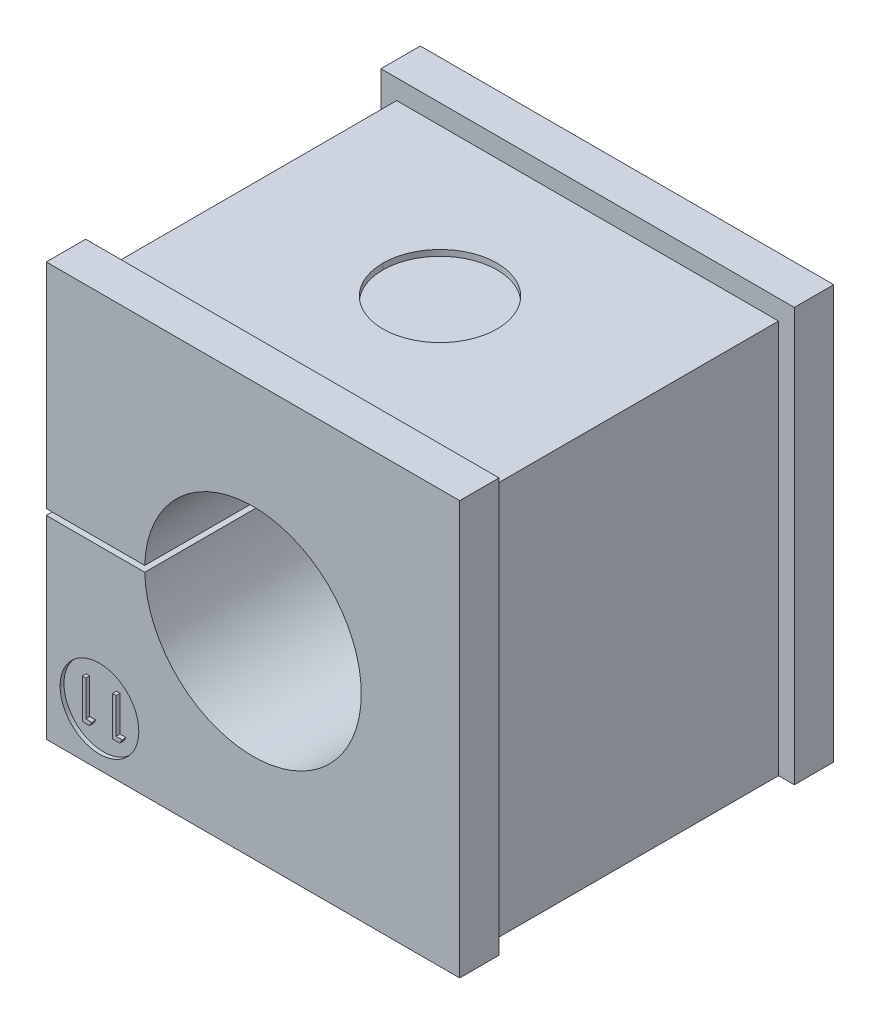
ISO-10303-21;
HEADER;
FILE_DESCRIPTION(('STEP AP214'),'2;1');
FILE_NAME('part.step','',(''),(''),'','','');
FILE_SCHEMA(('AUTOMOTIVE_DESIGN { 1 0 10303 214 1 1 1 1 }'));
ENDSEC;
DATA;
#1=APPLICATION_CONTEXT('core data for automotive mechanical design processes');
#2=APPLICATION_PROTOCOL_DEFINITION('international standard','automotive_design',2000,#1);
#3=PRODUCT_CONTEXT('',#1,'mechanical');
#4=PRODUCT('Part','Part','',(#3));
#5=PRODUCT_RELATED_PRODUCT_CATEGORY('part','',(#4));
#6=PRODUCT_DEFINITION_FORMATION('','',#4);
#7=PRODUCT_DEFINITION_CONTEXT('part definition',#1,'design');
#8=PRODUCT_DEFINITION('design','',#6,#7);
#9=PRODUCT_DEFINITION_SHAPE('','',#8);
#10=(LENGTH_UNIT() NAMED_UNIT(*) SI_UNIT(.MILLI.,.METRE.));
#11=(NAMED_UNIT(*) PLANE_ANGLE_UNIT() SI_UNIT($,.RADIAN.));
#12=(NAMED_UNIT(*) SI_UNIT($,.STERADIAN.) SOLID_ANGLE_UNIT());
#13=UNCERTAINTY_MEASURE_WITH_UNIT(LENGTH_MEASURE(1.E-05),#10,'distance_accuracy_value','');
#14=(GEOMETRIC_REPRESENTATION_CONTEXT(3) GLOBAL_UNCERTAINTY_ASSIGNED_CONTEXT((#13)) GLOBAL_UNIT_ASSIGNED_CONTEXT((#10,
#11,#12)) REPRESENTATION_CONTEXT('',''));
#15=CARTESIAN_POINT('',(0.,0.,0.));
#16=DIRECTION('',(0.,0.,1.));
#17=DIRECTION('',(1.,0.,0.));
#18=AXIS2_PLACEMENT_3D('',#15,#16,#17);
#19=CARTESIAN_POINT('',(0.,0.,9.5));
#20=DIRECTION('',(0.,0.,-1.));
#21=DIRECTION('',(0.,-1.,0.));
#22=AXIS2_PLACEMENT_3D('',#19,#20,#21);
#23=PLANE('',#22);
#24=DIRECTION('',(-0.496686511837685,-0.867930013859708,0.));
#25=VECTOR('',#24,1.);
#26=CARTESIAN_POINT('',(2.31538461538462,-8.59487179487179,9.5));
#27=LINE('',#26,#25);
#28=CARTESIAN_POINT('',(2.31538461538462,-8.59487179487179,9.5));
#29=VERTEX_POINT('',#28);
#30=CARTESIAN_POINT('',(2.19799679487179,-8.8,9.5));
#31=VERTEX_POINT('',#30);
#32=EDGE_CURVE('E398',#29,#31,#27,.T.);
#33=ORIENTED_EDGE('',*,*,#32,.F.);
#34=DIRECTION('',(1.,0.,0.));
#35=VECTOR('',#34,1.);
#36=CARTESIAN_POINT('',(2.00769230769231,-8.59487179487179,9.5));
#37=LINE('',#36,#35);
#38=CARTESIAN_POINT('',(2.00769230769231,-8.59487179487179,9.5));
#39=VERTEX_POINT('',#38);
#40=EDGE_CURVE('E308',#39,#29,#37,.T.);
#41=ORIENTED_EDGE('',*,*,#40,.F.);
#42=DIRECTION('',(0.,-1.,0.));
#43=VECTOR('',#42,1.);
#44=CARTESIAN_POINT('',(2.00769230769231,-6.8,9.5));
#45=LINE('',#44,#43);
#46=CARTESIAN_POINT('',(2.00769230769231,-6.8,9.5));
#47=VERTEX_POINT('',#46);
#48=EDGE_CURVE('E306',#47,#39,#45,.T.);
#49=ORIENTED_EDGE('',*,*,#48,.F.);
#50=DIRECTION('',(1.,0.,0.));
#51=VECTOR('',#50,1.);
#52=CARTESIAN_POINT('',(1.82820512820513,-6.8,9.5));
#53=LINE('',#52,#51);
#54=CARTESIAN_POINT('',(1.82820512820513,-6.8,9.5));
#55=VERTEX_POINT('',#54);
#56=EDGE_CURVE('E18',#55,#47,#53,.T.);
#57=ORIENTED_EDGE('',*,*,#56,.F.);
#58=DIRECTION('',(0.,1.,0.));
#59=VECTOR('',#58,1.);
#60=CARTESIAN_POINT('',(1.82820512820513,-8.8,9.5));
#61=LINE('',#60,#59);
#62=CARTESIAN_POINT('',(1.82820512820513,-8.8,9.5));
#63=VERTEX_POINT('',#62);
#64=EDGE_CURVE('E25',#63,#55,#61,.T.);
#65=ORIENTED_EDGE('',*,*,#64,.F.);
#66=DIRECTION('',(-1.,0.,0.));
#67=VECTOR('',#66,1.);
#68=CARTESIAN_POINT('',(2.19799679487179,-8.8,9.5));
#69=LINE('',#68,#67);
#70=EDGE_CURVE('E9',#31,#63,#69,.T.);
#71=ORIENTED_EDGE('',*,*,#70,.F.);
#72=EDGE_LOOP('',(#33,#41,#49,#57,#65,#71));
#73=FACE_BOUND('',#72,.T.);
#74=ADVANCED_FACE('F15',(#73),#23,.F.);
#75=CARTESIAN_POINT('',(2.19799679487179,-8.8,9.5));
#76=DIRECTION('',(0.,-1.,0.));
#77=DIRECTION('',(0.,0.,-1.));
#78=AXIS2_PLACEMENT_3D('',#75,#76,#77);
#79=PLANE('',#78);
#80=DIRECTION('',(-1.,0.,0.));
#81=VECTOR('',#80,1.);
#82=CARTESIAN_POINT('',(2.19799679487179,-8.8,9.3));
#83=LINE('',#82,#81);
#84=CARTESIAN_POINT('',(2.19799679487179,-8.8,9.3));
#85=VERTEX_POINT('',#84);
#86=CARTESIAN_POINT('',(1.82820512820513,-8.8,9.3));
#87=VERTEX_POINT('',#86);
#88=EDGE_CURVE('E341',#85,#87,#83,.T.);
#89=ORIENTED_EDGE('',*,*,#88,.F.);
#90=DIRECTION('',(0.,0.,-1.));
#91=VECTOR('',#90,1.);
#92=CARTESIAN_POINT('',(2.19799679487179,-8.8,9.5));
#93=LINE('',#92,#91);
#94=EDGE_CURVE('E406',#31,#85,#93,.T.);
#95=ORIENTED_EDGE('',*,*,#94,.F.);
#96=ORIENTED_EDGE('',*,*,#70,.T.);
#97=DIRECTION('',(0.,0.,-1.));
#98=VECTOR('',#97,1.);
#99=CARTESIAN_POINT('',(1.82820512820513,-8.8,9.5));
#100=LINE('',#99,#98);
#101=EDGE_CURVE('E304',#63,#87,#100,.T.);
#102=ORIENTED_EDGE('',*,*,#101,.T.);
#103=EDGE_LOOP('',(#89,#95,#96,#102));
#104=FACE_BOUND('',#103,.T.);
#105=ADVANCED_FACE('F861',(#104),#79,.T.);
#106=CARTESIAN_POINT('',(1.82820512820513,-8.8,9.5));
#107=DIRECTION('',(-1.,0.,0.));
#108=DIRECTION('',(0.,0.,1.));
#109=AXIS2_PLACEMENT_3D('',#106,#107,#108);
#110=PLANE('',#109);
#111=DIRECTION('',(0.,1.,0.));
#112=VECTOR('',#111,1.);
#113=CARTESIAN_POINT('',(1.82820512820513,-8.8,9.3));
#114=LINE('',#113,#112);
#115=CARTESIAN_POINT('',(1.82820512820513,-6.8,9.3));
#116=VERTEX_POINT('',#115);
#117=EDGE_CURVE('E331',#87,#116,#114,.T.);
#118=ORIENTED_EDGE('',*,*,#117,.F.);
#119=ORIENTED_EDGE('',*,*,#101,.F.);
#120=ORIENTED_EDGE('',*,*,#64,.T.);
#121=DIRECTION('',(0.,0.,-1.));
#122=VECTOR('',#121,1.);
#123=CARTESIAN_POINT('',(1.82820512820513,-6.8,9.5));
#124=LINE('',#123,#122);
#125=EDGE_CURVE('E301',#55,#116,#124,.T.);
#126=ORIENTED_EDGE('',*,*,#125,.T.);
#127=EDGE_LOOP('',(#118,#119,#120,#126));
#128=FACE_BOUND('',#127,.T.);
#129=ADVANCED_FACE('F328',(#128),#110,.T.);
#130=CARTESIAN_POINT('',(1.82820512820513,-6.8,9.5));
#131=DIRECTION('',(0.,1.,0.));
#132=DIRECTION('',(1.,0.,0.));
#133=AXIS2_PLACEMENT_3D('',#130,#131,#132);
#134=PLANE('',#133);
#135=DIRECTION('',(1.,0.,0.));
#136=VECTOR('',#135,1.);
#137=CARTESIAN_POINT('',(1.82820512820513,-6.8,9.3));
#138=LINE('',#137,#136);
#139=CARTESIAN_POINT('',(2.00769230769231,-6.8,9.3));
#140=VERTEX_POINT('',#139);
#141=EDGE_CURVE('E333',#116,#140,#138,.T.);
#142=ORIENTED_EDGE('',*,*,#141,.F.);
#143=ORIENTED_EDGE('',*,*,#125,.F.);
#144=ORIENTED_EDGE('',*,*,#56,.T.);
#145=DIRECTION('',(0.,0.,-1.));
#146=VECTOR('',#145,1.);
#147=CARTESIAN_POINT('',(2.00769230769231,-6.8,9.5));
#148=LINE('',#147,#146);
#149=EDGE_CURVE('E299',#47,#140,#148,.T.);
#150=ORIENTED_EDGE('',*,*,#149,.T.);
#151=EDGE_LOOP('',(#142,#143,#144,#150));
#152=FACE_BOUND('',#151,.T.);
#153=ADVANCED_FACE('F297',(#152),#134,.T.);
#154=CARTESIAN_POINT('',(2.00769230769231,-6.8,9.5));
#155=DIRECTION('',(1.,0.,0.));
#156=DIRECTION('',(0.,1.,0.));
#157=AXIS2_PLACEMENT_3D('',#154,#155,#156);
#158=PLANE('',#157);
#159=DIRECTION('',(0.,-1.,0.));
#160=VECTOR('',#159,1.);
#161=CARTESIAN_POINT('',(2.00769230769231,-6.8,9.3));
#162=LINE('',#161,#160);
#163=CARTESIAN_POINT('',(2.00769230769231,-8.59487179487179,9.3));
#164=VERTEX_POINT('',#163);
#165=EDGE_CURVE('E315',#140,#164,#162,.T.);
#166=ORIENTED_EDGE('',*,*,#165,.F.);
#167=ORIENTED_EDGE('',*,*,#149,.F.);
#168=ORIENTED_EDGE('',*,*,#48,.T.);
#169=DIRECTION('',(0.,0.,-1.));
#170=VECTOR('',#169,1.);
#171=CARTESIAN_POINT('',(2.00769230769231,-8.59487179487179,9.5));
#172=LINE('',#171,#170);
#173=EDGE_CURVE('E321',#39,#164,#172,.T.);
#174=ORIENTED_EDGE('',*,*,#173,.T.);
#175=EDGE_LOOP('',(#166,#167,#168,#174));
#176=FACE_BOUND('',#175,.T.);
#177=ADVANCED_FACE('F313',(#176),#158,.T.);
#178=CARTESIAN_POINT('',(2.00769230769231,-8.59487179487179,9.5));
#179=DIRECTION('',(0.,1.,0.));
#180=DIRECTION('',(1.,0.,0.));
#181=AXIS2_PLACEMENT_3D('',#178,#179,#180);
#182=PLANE('',#181);
#183=DIRECTION('',(1.,0.,0.));
#184=VECTOR('',#183,1.);
#185=CARTESIAN_POINT('',(2.00769230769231,-8.59487179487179,9.3));
#186=LINE('',#185,#184);
#187=CARTESIAN_POINT('',(2.31538461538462,-8.59487179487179,9.3));
#188=VERTEX_POINT('',#187);
#189=EDGE_CURVE('E355',#164,#188,#186,.T.);
#190=ORIENTED_EDGE('',*,*,#189,.F.);
#191=ORIENTED_EDGE('',*,*,#173,.F.);
#192=ORIENTED_EDGE('',*,*,#40,.T.);
#193=DIRECTION('',(0.,0.,-1.));
#194=VECTOR('',#193,1.);
#195=CARTESIAN_POINT('',(2.31538461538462,-8.59487179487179,9.5));
#196=LINE('',#195,#194);
#197=EDGE_CURVE('E396',#29,#188,#196,.T.);
#198=ORIENTED_EDGE('',*,*,#197,.T.);
#199=EDGE_LOOP('',(#190,#191,#192,#198));
#200=FACE_BOUND('',#199,.T.);
#201=ADVANCED_FACE('F523',(#200),#182,.T.);
#202=CARTESIAN_POINT('',(2.31538461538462,-8.59487179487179,9.5));
#203=DIRECTION('',(0.867930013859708,-0.496686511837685,0.));
#204=DIRECTION('',(0.,0.,-1.));
#205=AXIS2_PLACEMENT_3D('',#202,#203,#204);
#206=PLANE('',#205);
#207=DIRECTION('',(-0.496686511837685,-0.867930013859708,0.));
#208=VECTOR('',#207,1.);
#209=CARTESIAN_POINT('',(2.31538461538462,-8.59487179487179,9.3));
#210=LINE('',#209,#208);
#211=EDGE_CURVE('E347',#188,#85,#210,.T.);
#212=ORIENTED_EDGE('',*,*,#211,.F.);
#213=ORIENTED_EDGE('',*,*,#197,.F.);
#214=ORIENTED_EDGE('',*,*,#32,.T.);
#215=ORIENTED_EDGE('',*,*,#94,.T.);
#216=EDGE_LOOP('',(#212,#213,#214,#215));
#217=FACE_BOUND('',#216,.T.);
#218=ADVANCED_FACE('F526',(#217),#206,.T.);
#219=CARTESIAN_POINT('',(0.,0.,9.5));
#220=DIRECTION('',(0.,0.,-1.));
#221=DIRECTION('',(0.,-1.,0.));
#222=AXIS2_PLACEMENT_3D('',#219,#220,#221);
#223=PLANE('',#222);
#224=DIRECTION('',(-0.496686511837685,-0.867930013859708,0.));
#225=VECTOR('',#224,1.);
#226=CARTESIAN_POINT('',(3.85384615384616,-8.59487179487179,9.5));
#227=LINE('',#226,#225);
#228=CARTESIAN_POINT('',(3.85384615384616,-8.59487179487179,9.5));
#229=VERTEX_POINT('',#228);
#230=CARTESIAN_POINT('',(3.73645833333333,-8.8,9.5));
#231=VERTEX_POINT('',#230);
#232=EDGE_CURVE('E375',#229,#231,#227,.T.);
#233=ORIENTED_EDGE('',*,*,#232,.F.);
#234=DIRECTION('',(1.,0.,0.));
#235=VECTOR('',#234,1.);
#236=CARTESIAN_POINT('',(3.54615384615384,-8.59487179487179,9.5));
#237=LINE('',#236,#235);
#238=CARTESIAN_POINT('',(3.54615384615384,-8.59487179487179,9.5));
#239=VERTEX_POINT('',#238);
#240=EDGE_CURVE('E381',#239,#229,#237,.T.);
#241=ORIENTED_EDGE('',*,*,#240,.F.);
#242=DIRECTION('',(0.,-1.,0.));
#243=VECTOR('',#242,1.);
#244=CARTESIAN_POINT('',(3.54615384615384,-6.8,9.5));
#245=LINE('',#244,#243);
#246=CARTESIAN_POINT('',(3.54615384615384,-6.8,9.5));
#247=VERTEX_POINT('',#246);
#248=EDGE_CURVE('E388',#247,#239,#245,.T.);
#249=ORIENTED_EDGE('',*,*,#248,.F.);
#250=DIRECTION('',(1.,0.,0.));
#251=VECTOR('',#250,1.);
#252=CARTESIAN_POINT('',(3.36666666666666,-6.8,9.5));
#253=LINE('',#252,#251);
#254=CARTESIAN_POINT('',(3.36666666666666,-6.8,9.5));
#255=VERTEX_POINT('',#254);
#256=EDGE_CURVE('E389',#255,#247,#253,.T.);
#257=ORIENTED_EDGE('',*,*,#256,.F.);
#258=DIRECTION('',(0.,1.,0.));
#259=VECTOR('',#258,1.);
#260=CARTESIAN_POINT('',(3.36666666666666,-8.8,9.5));
#261=LINE('',#260,#259);
#262=CARTESIAN_POINT('',(3.36666666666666,-8.8,9.5));
#263=VERTEX_POINT('',#262);
#264=EDGE_CURVE('E395',#263,#255,#261,.T.);
#265=ORIENTED_EDGE('',*,*,#264,.F.);
#266=DIRECTION('',(-1.,0.,0.));
#267=VECTOR('',#266,1.);
#268=CARTESIAN_POINT('',(3.73645833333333,-8.8,9.5));
#269=LINE('',#268,#267);
#270=EDGE_CURVE('E399',#231,#263,#269,.T.);
#271=ORIENTED_EDGE('',*,*,#270,.F.);
#272=EDGE_LOOP('',(#233,#241,#249,#257,#265,#271));
#273=FACE_BOUND('',#272,.T.);
#274=ADVANCED_FACE('F876',(#273),#223,.F.);
#275=CARTESIAN_POINT('',(3.73645833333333,-8.8,9.5));
#276=DIRECTION('',(0.,-1.,0.));
#277=DIRECTION('',(0.,0.,-1.));
#278=AXIS2_PLACEMENT_3D('',#275,#276,#277);
#279=PLANE('',#278);
#280=DIRECTION('',(-1.,0.,0.));
#281=VECTOR('',#280,1.);
#282=CARTESIAN_POINT('',(3.73645833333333,-8.8,9.3));
#283=LINE('',#282,#281);
#284=CARTESIAN_POINT('',(3.73645833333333,-8.8,9.3));
#285=VERTEX_POINT('',#284);
#286=CARTESIAN_POINT('',(3.36666666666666,-8.8,9.3));
#287=VERTEX_POINT('',#286);
#288=EDGE_CURVE('E366',#285,#287,#283,.T.);
#289=ORIENTED_EDGE('',*,*,#288,.F.);
#290=DIRECTION('',(0.,0.,-1.));
#291=VECTOR('',#290,1.);
#292=CARTESIAN_POINT('',(3.73645833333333,-8.8,9.5));
#293=LINE('',#292,#291);
#294=EDGE_CURVE('E380',#231,#285,#293,.T.);
#295=ORIENTED_EDGE('',*,*,#294,.F.);
#296=ORIENTED_EDGE('',*,*,#270,.T.);
#297=DIRECTION('',(0.,0.,-1.));
#298=VECTOR('',#297,1.);
#299=CARTESIAN_POINT('',(3.36666666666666,-8.8,9.5));
#300=LINE('',#299,#298);
#301=EDGE_CURVE('E392',#263,#287,#300,.T.);
#302=ORIENTED_EDGE('',*,*,#301,.T.);
#303=EDGE_LOOP('',(#289,#295,#296,#302));
#304=FACE_BOUND('',#303,.T.);
#305=ADVANCED_FACE('F877',(#304),#279,.T.);
#306=CARTESIAN_POINT('',(3.36666666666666,-8.8,9.5));
#307=DIRECTION('',(-1.,0.,0.));
#308=DIRECTION('',(0.,0.,1.));
#309=AXIS2_PLACEMENT_3D('',#306,#307,#308);
#310=PLANE('',#309);
#311=DIRECTION('',(0.,1.,0.));
#312=VECTOR('',#311,1.);
#313=CARTESIAN_POINT('',(3.36666666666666,-8.8,9.3));
#314=LINE('',#313,#312);
#315=CARTESIAN_POINT('',(3.36666666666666,-6.8,9.3));
#316=VERTEX_POINT('',#315);
#317=EDGE_CURVE('E371',#287,#316,#314,.T.);
#318=ORIENTED_EDGE('',*,*,#317,.F.);
#319=ORIENTED_EDGE('',*,*,#301,.F.);
#320=ORIENTED_EDGE('',*,*,#264,.T.);
#321=DIRECTION('',(0.,0.,-1.));
#322=VECTOR('',#321,1.);
#323=CARTESIAN_POINT('',(3.36666666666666,-6.8,9.5));
#324=LINE('',#323,#322);
#325=EDGE_CURVE('E393',#255,#316,#324,.T.);
#326=ORIENTED_EDGE('',*,*,#325,.T.);
#327=EDGE_LOOP('',(#318,#319,#320,#326));
#328=FACE_BOUND('',#327,.T.);
#329=ADVANCED_FACE('F880',(#328),#310,.T.);
#330=CARTESIAN_POINT('',(3.36666666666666,-6.8,9.5));
#331=DIRECTION('',(0.,1.,0.));
#332=DIRECTION('',(1.,0.,0.));
#333=AXIS2_PLACEMENT_3D('',#330,#331,#332);
#334=PLANE('',#333);
#335=DIRECTION('',(1.,0.,0.));
#336=VECTOR('',#335,1.);
#337=CARTESIAN_POINT('',(3.36666666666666,-6.8,9.3));
#338=LINE('',#337,#336);
#339=CARTESIAN_POINT('',(3.54615384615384,-6.8,9.3));
#340=VERTEX_POINT('',#339);
#341=EDGE_CURVE('E585',#316,#340,#338,.T.);
#342=ORIENTED_EDGE('',*,*,#341,.F.);
#343=ORIENTED_EDGE('',*,*,#325,.F.);
#344=ORIENTED_EDGE('',*,*,#256,.T.);
#345=DIRECTION('',(0.,0.,-1.));
#346=VECTOR('',#345,1.);
#347=CARTESIAN_POINT('',(3.54615384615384,-6.8,9.5));
#348=LINE('',#347,#346);
#349=EDGE_CURVE('E384',#247,#340,#348,.T.);
#350=ORIENTED_EDGE('',*,*,#349,.T.);
#351=EDGE_LOOP('',(#342,#343,#344,#350));
#352=FACE_BOUND('',#351,.T.);
#353=ADVANCED_FACE('F883',(#352),#334,.T.);
#354=CARTESIAN_POINT('',(3.54615384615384,-6.8,9.5));
#355=DIRECTION('',(1.,0.,0.));
#356=DIRECTION('',(0.,1.,0.));
#357=AXIS2_PLACEMENT_3D('',#354,#355,#356);
#358=PLANE('',#357);
#359=DIRECTION('',(0.,-1.,0.));
#360=VECTOR('',#359,1.);
#361=CARTESIAN_POINT('',(3.54615384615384,-6.8,9.3));
#362=LINE('',#361,#360);
#363=CARTESIAN_POINT('',(3.54615384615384,-8.59487179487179,9.3));
#364=VERTEX_POINT('',#363);
#365=EDGE_CURVE('E440',#340,#364,#362,.T.);
#366=ORIENTED_EDGE('',*,*,#365,.F.);
#367=ORIENTED_EDGE('',*,*,#349,.F.);
#368=ORIENTED_EDGE('',*,*,#248,.T.);
#369=DIRECTION('',(0.,0.,-1.));
#370=VECTOR('',#369,1.);
#371=CARTESIAN_POINT('',(3.54615384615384,-8.59487179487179,9.5));
#372=LINE('',#371,#370);
#373=EDGE_CURVE('E385',#239,#364,#372,.T.);
#374=ORIENTED_EDGE('',*,*,#373,.T.);
#375=EDGE_LOOP('',(#366,#367,#368,#374));
#376=FACE_BOUND('',#375,.T.);
#377=ADVANCED_FACE('F887',(#376),#358,.T.);
#378=CARTESIAN_POINT('',(3.54615384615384,-8.59487179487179,9.5));
#379=DIRECTION('',(0.,1.,0.));
#380=DIRECTION('',(1.,0.,0.));
#381=AXIS2_PLACEMENT_3D('',#378,#379,#380);
#382=PLANE('',#381);
#383=DIRECTION('',(1.,0.,0.));
#384=VECTOR('',#383,1.);
#385=CARTESIAN_POINT('',(3.54615384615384,-8.59487179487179,9.3));
#386=LINE('',#385,#384);
#387=CARTESIAN_POINT('',(3.85384615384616,-8.59487179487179,9.3));
#388=VERTEX_POINT('',#387);
#389=EDGE_CURVE('E376',#364,#388,#386,.T.);
#390=ORIENTED_EDGE('',*,*,#389,.F.);
#391=ORIENTED_EDGE('',*,*,#373,.F.);
#392=ORIENTED_EDGE('',*,*,#240,.T.);
#393=DIRECTION('',(0.,0.,-1.));
#394=VECTOR('',#393,1.);
#395=CARTESIAN_POINT('',(3.85384615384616,-8.59487179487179,9.5));
#396=LINE('',#395,#394);
#397=EDGE_CURVE('E372',#229,#388,#396,.T.);
#398=ORIENTED_EDGE('',*,*,#397,.T.);
#399=EDGE_LOOP('',(#390,#391,#392,#398));
#400=FACE_BOUND('',#399,.T.);
#401=ADVANCED_FACE('F891',(#400),#382,.T.);
#402=CARTESIAN_POINT('',(3.85384615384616,-8.59487179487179,9.5));
#403=DIRECTION('',(0.867930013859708,-0.496686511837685,0.));
#404=DIRECTION('',(0.,0.,-1.));
#405=AXIS2_PLACEMENT_3D('',#402,#403,#404);
#406=PLANE('',#405);
#407=DIRECTION('',(-0.496686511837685,-0.867930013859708,0.));
#408=VECTOR('',#407,1.);
#409=CARTESIAN_POINT('',(3.85384615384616,-8.59487179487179,9.3));
#410=LINE('',#409,#408);
#411=EDGE_CURVE('E361',#388,#285,#410,.T.);
#412=ORIENTED_EDGE('',*,*,#411,.F.);
#413=ORIENTED_EDGE('',*,*,#397,.F.);
#414=ORIENTED_EDGE('',*,*,#232,.T.);
#415=ORIENTED_EDGE('',*,*,#294,.T.);
#416=EDGE_LOOP('',(#412,#413,#414,#415));
#417=FACE_BOUND('',#416,.T.);
#418=ADVANCED_FACE('F893',(#417),#406,.T.);
#419=CARTESIAN_POINT('',(10.5,-0.5,-25.0563491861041));
#420=DIRECTION('',(0.,0.,1.));
#421=DIRECTION('',(1.,0.,0.));
#422=AXIS2_PLACEMENT_3D('',#419,#420,#421);
#423=CYLINDRICAL_SURFACE('',#422,5.5);
#424=DIRECTION('',(0.,0.,1.));
#425=VECTOR('',#424,1.);
#426=CARTESIAN_POINT('',(16.,-0.5,-25.0563491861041));
#427=LINE('',#426,#425);
#428=CARTESIAN_POINT('',(16.,-0.5,-9.5));
#429=VERTEX_POINT('',#428);
#430=CARTESIAN_POINT('',(16.,-0.5,9.5));
#431=VERTEX_POINT('',#430);
#432=EDGE_CURVE('E728',#429,#431,#427,.T.);
#433=ORIENTED_EDGE('',*,*,#432,.F.);
#434=CARTESIAN_POINT('',(10.5,-0.5,-9.5));
#435=DIRECTION('',(0.,0.,1.));
#436=DIRECTION('',(-1.,0.,0.));
#437=AXIS2_PLACEMENT_3D('',#434,#435,#436);
#438=CIRCLE('',#437,5.5);
#439=CARTESIAN_POINT('',(5.0020458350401,-0.65,-9.5));
#440=VERTEX_POINT('',#439);
#441=EDGE_CURVE('E427',#440,#429,#438,.T.);
#442=ORIENTED_EDGE('',*,*,#441,.F.);
#443=DIRECTION('',(0.,0.,1.));
#444=VECTOR('',#443,1.);
#445=CARTESIAN_POINT('',(5.0020458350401,-0.65,-25.0563491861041));
#446=LINE('',#445,#444);
#447=CARTESIAN_POINT('',(5.0020458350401,-0.65,9.5));
#448=VERTEX_POINT('',#447);
#449=EDGE_CURVE('E665',#440,#448,#446,.T.);
#450=ORIENTED_EDGE('',*,*,#449,.T.);
#451=CARTESIAN_POINT('',(10.5,-0.5,9.5));
#452=DIRECTION('',(0.,0.,1.));
#453=DIRECTION('',(1.,0.,0.));
#454=AXIS2_PLACEMENT_3D('',#451,#452,#453);
#455=CIRCLE('',#454,5.5);
#456=EDGE_CURVE('E513',#448,#431,#455,.T.);
#457=ORIENTED_EDGE('',*,*,#456,.T.);
#458=EDGE_LOOP('',(#433,#442,#450,#457));
#459=FACE_BOUND('',#458,.T.);
#460=ADVANCED_FACE('F811',(#459),#423,.F.);
#461=CARTESIAN_POINT('',(2.7,-7.8,9.3));
#462=DIRECTION('',(0.,0.,1.));
#463=DIRECTION('',(1.,0.,0.));
#464=AXIS2_PLACEMENT_3D('',#461,#462,#463);
#465=PLANE('',#464);
#466=ORIENTED_EDGE('',*,*,#411,.T.);
#467=ORIENTED_EDGE('',*,*,#288,.T.);
#468=ORIENTED_EDGE('',*,*,#317,.T.);
#469=ORIENTED_EDGE('',*,*,#341,.T.);
#470=ORIENTED_EDGE('',*,*,#365,.T.);
#471=ORIENTED_EDGE('',*,*,#389,.T.);
#472=EDGE_LOOP('',(#466,#467,#468,#469,#470,#471));
#473=FACE_BOUND('',#472,.T.);
#474=ORIENTED_EDGE('',*,*,#211,.T.);
#475=ORIENTED_EDGE('',*,*,#88,.T.);
#476=ORIENTED_EDGE('',*,*,#117,.T.);
#477=ORIENTED_EDGE('',*,*,#141,.T.);
#478=ORIENTED_EDGE('',*,*,#165,.T.);
#479=ORIENTED_EDGE('',*,*,#189,.T.);
#480=EDGE_LOOP('',(#474,#475,#476,#477,#478,#479));
#481=FACE_BOUND('',#480,.T.);
#482=CARTESIAN_POINT('',(2.7,-7.8,9.3));
#483=DIRECTION('',(0.,0.,1.));
#484=DIRECTION('',(1.,0.,0.));
#485=AXIS2_PLACEMENT_3D('',#482,#483,#484);
#486=CIRCLE('',#485,2.);
#487=CARTESIAN_POINT('',(4.7,-7.8,9.3));
#488=VERTEX_POINT('',#487);
#489=CARTESIAN_POINT('',(0.7,-7.8,9.3));
#490=VERTEX_POINT('',#489);
#491=EDGE_CURVE('E350',#488,#490,#486,.T.);
#492=ORIENTED_EDGE('',*,*,#491,.T.);
#493=CARTESIAN_POINT('',(2.7,-7.8,9.3));
#494=DIRECTION('',(0.,0.,1.));
#495=DIRECTION('',(1.,0.,0.));
#496=AXIS2_PLACEMENT_3D('',#493,#494,#495);
#497=CIRCLE('',#496,2.);
#498=EDGE_CURVE('E690',#490,#488,#497,.T.);
#499=ORIENTED_EDGE('',*,*,#498,.T.);
#500=EDGE_LOOP('',(#492,#499));
#501=FACE_BOUND('',#500,.T.);
#502=ADVANCED_FACE('F338',(#473,#481,#501),#465,.T.);
#503=CARTESIAN_POINT('',(2.7,-7.8,9.3));
#504=DIRECTION('',(0.,0.,1.));
#505=DIRECTION('',(1.,0.,0.));
#506=AXIS2_PLACEMENT_3D('',#503,#504,#505);
#507=CYLINDRICAL_SURFACE('',#506,2.);
#508=DIRECTION('',(0.,0.,1.));
#509=VECTOR('',#508,1.);
#510=CARTESIAN_POINT('',(0.7,-7.8,9.3));
#511=LINE('',#510,#509);
#512=CARTESIAN_POINT('',(0.7,-7.8,9.5));
#513=VERTEX_POINT('',#512);
#514=EDGE_CURVE('E693',#490,#513,#511,.T.);
#515=ORIENTED_EDGE('',*,*,#514,.F.);
#516=ORIENTED_EDGE('',*,*,#491,.F.);
#517=DIRECTION('',(0.,0.,1.));
#518=VECTOR('',#517,1.);
#519=CARTESIAN_POINT('',(4.7,-7.8,9.3));
#520=LINE('',#519,#518);
#521=CARTESIAN_POINT('',(4.7,-7.8,9.5));
#522=VERTEX_POINT('',#521);
#523=EDGE_CURVE('E703',#488,#522,#520,.T.);
#524=ORIENTED_EDGE('',*,*,#523,.T.);
#525=CARTESIAN_POINT('',(2.7,-7.8,9.5));
#526=DIRECTION('',(0.,0.,1.));
#527=DIRECTION('',(1.,0.,0.));
#528=AXIS2_PLACEMENT_3D('',#525,#526,#527);
#529=CIRCLE('',#528,2.);
#530=EDGE_CURVE('E432',#522,#513,#529,.T.);
#531=ORIENTED_EDGE('',*,*,#530,.T.);
#532=EDGE_LOOP('',(#515,#516,#524,#531));
#533=FACE_BOUND('',#532,.T.);
#534=ADVANCED_FACE('F858',(#533),#507,.F.);
#535=CARTESIAN_POINT('',(10.5,9.2,0.));
#536=DIRECTION('',(0.,1.,0.));
#537=DIRECTION('',(-1.,0.,0.));
#538=AXIS2_PLACEMENT_3D('',#535,#536,#537);
#539=CYLINDRICAL_SURFACE('',#538,2.9);
#540=DIRECTION('',(0.,1.,0.));
#541=VECTOR('',#540,1.);
#542=CARTESIAN_POINT('',(13.4,9.2,0.));
#543=LINE('',#542,#541);
#544=CARTESIAN_POINT('',(13.4,9.2,0.));
#545=VERTEX_POINT('',#544);
#546=CARTESIAN_POINT('',(13.4,9.5,0.));
#547=VERTEX_POINT('',#546);
#548=EDGE_CURVE('E658',#545,#547,#543,.T.);
#549=ORIENTED_EDGE('',*,*,#548,.F.);
#550=CARTESIAN_POINT('',(10.5,9.2,0.));
#551=DIRECTION('',(0.,1.,0.));
#552=DIRECTION('',(-1.,0.,0.));
#553=AXIS2_PLACEMENT_3D('',#550,#551,#552);
#554=CIRCLE('',#553,2.9);
#555=CARTESIAN_POINT('',(7.6,9.2,0.));
#556=VERTEX_POINT('',#555);
#557=EDGE_CURVE('E431',#556,#545,#554,.T.);
#558=ORIENTED_EDGE('',*,*,#557,.F.);
#559=DIRECTION('',(0.,1.,0.));
#560=VECTOR('',#559,1.);
#561=CARTESIAN_POINT('',(7.6,9.2,0.));
#562=LINE('',#561,#560);
#563=CARTESIAN_POINT('',(7.6,9.5,0.));
#564=VERTEX_POINT('',#563);
#565=EDGE_CURVE('E660',#556,#564,#562,.T.);
#566=ORIENTED_EDGE('',*,*,#565,.T.);
#567=CARTESIAN_POINT('',(10.5,9.5,0.));
#568=DIRECTION('',(0.,-1.,0.));
#569=DIRECTION('',(1.,0.,0.));
#570=AXIS2_PLACEMENT_3D('',#567,#568,#569);
#571=CIRCLE('',#570,2.9);
#572=EDGE_CURVE('E446',#547,#564,#571,.T.);
#573=ORIENTED_EDGE('',*,*,#572,.F.);
#574=EDGE_LOOP('',(#549,#558,#566,#573));
#575=FACE_BOUND('',#574,.T.);
#576=ADVANCED_FACE('F845',(#575),#539,.F.);
#577=CARTESIAN_POINT('',(10.5,9.2,0.));
#578=DIRECTION('',(0.,1.,0.));
#579=DIRECTION('',(1.,0.,0.));
#580=AXIS2_PLACEMENT_3D('',#577,#578,#579);
#581=PLANE('',#580);
#582=ORIENTED_EDGE('',*,*,#557,.T.);
#583=CARTESIAN_POINT('',(10.5,9.2,0.));
#584=DIRECTION('',(0.,1.,0.));
#585=DIRECTION('',(-1.,0.,0.));
#586=AXIS2_PLACEMENT_3D('',#583,#584,#585);
#587=CIRCLE('',#586,2.9);
#588=EDGE_CURVE('E709',#545,#556,#587,.T.);
#589=ORIENTED_EDGE('',*,*,#588,.T.);
#590=EDGE_LOOP('',(#582,#589));
#591=FACE_BOUND('',#590,.T.);
#592=ADVANCED_FACE('F846',(#591),#581,.T.);
#593=CARTESIAN_POINT('',(1.3,0.,7.5));
#594=DIRECTION('',(0.,0.,1.));
#595=DIRECTION('',(1.,0.,0.));
#596=AXIS2_PLACEMENT_3D('',#593,#594,#595);
#597=PLANE('',#596);
#598=DIRECTION('',(0.,1.,0.));
#599=VECTOR('',#598,1.);
#600=CARTESIAN_POINT('',(0.,0.,7.5));
#601=LINE('',#600,#599);
#602=CARTESIAN_POINT('',(0.,-10.5,7.5));
#603=VERTEX_POINT('',#602);
#604=CARTESIAN_POINT('',(0.,-0.65,7.5));
#605=VERTEX_POINT('',#604);
#606=EDGE_CURVE('E497',#603,#605,#601,.T.);
#607=ORIENTED_EDGE('',*,*,#606,.T.);
#608=DIRECTION('',(1.,0.,0.));
#609=VECTOR('',#608,1.);
#610=CARTESIAN_POINT('',(1.3,-0.65,7.5));
#611=LINE('',#610,#609);
#612=CARTESIAN_POINT('',(0.8,-0.65,7.5));
#613=VERTEX_POINT('',#612);
#614=EDGE_CURVE('E540',#605,#613,#611,.T.);
#615=ORIENTED_EDGE('',*,*,#614,.T.);
#616=DIRECTION('',(0.,1.,0.));
#617=VECTOR('',#616,1.);
#618=CARTESIAN_POINT('',(0.8,9.5,7.5));
#619=LINE('',#618,#617);
#620=CARTESIAN_POINT('',(0.8,-10.5,7.5));
#621=VERTEX_POINT('',#620);
#622=EDGE_CURVE('E508',#621,#613,#619,.T.);
#623=ORIENTED_EDGE('',*,*,#622,.F.);
#624=DIRECTION('',(1.,0.,0.));
#625=VECTOR('',#624,1.);
#626=CARTESIAN_POINT('',(1.3,-10.5,7.5));
#627=LINE('',#626,#625);
#628=EDGE_CURVE('E489',#603,#621,#627,.T.);
#629=ORIENTED_EDGE('',*,*,#628,.F.);
#630=EDGE_LOOP('',(#607,#615,#623,#629));
#631=FACE_BOUND('',#630,.T.);
#632=ADVANCED_FACE('F848',(#631),#597,.F.);
#633=CARTESIAN_POINT('',(0.,0.,-7.5));
#634=DIRECTION('',(0.,0.,-1.));
#635=DIRECTION('',(-1.,0.,0.));
#636=AXIS2_PLACEMENT_3D('',#633,#634,#635);
#637=PLANE('',#636);
#638=DIRECTION('',(0.,-1.,0.));
#639=VECTOR('',#638,1.);
#640=CARTESIAN_POINT('',(0.8,9.5,-7.5));
#641=LINE('',#640,#639);
#642=CARTESIAN_POINT('',(0.8,-0.65,-7.5));
#643=VERTEX_POINT('',#642);
#644=CARTESIAN_POINT('',(0.8,-10.5,-7.5));
#645=VERTEX_POINT('',#644);
#646=EDGE_CURVE('E511',#643,#645,#641,.T.);
#647=ORIENTED_EDGE('',*,*,#646,.F.);
#648=DIRECTION('',(-1.,0.,0.));
#649=VECTOR('',#648,1.);
#650=CARTESIAN_POINT('',(0.,-0.65,-7.5));
#651=LINE('',#650,#649);
#652=CARTESIAN_POINT('',(0.,-0.65,-7.5));
#653=VERTEX_POINT('',#652);
#654=EDGE_CURVE('E535',#643,#653,#651,.T.);
#655=ORIENTED_EDGE('',*,*,#654,.T.);
#656=DIRECTION('',(0.,1.,0.));
#657=VECTOR('',#656,1.);
#658=CARTESIAN_POINT('',(0.,0.,-7.5));
#659=LINE('',#658,#657);
#660=CARTESIAN_POINT('',(0.,-10.5,-7.5));
#661=VERTEX_POINT('',#660);
#662=EDGE_CURVE('E500',#661,#653,#659,.T.);
#663=ORIENTED_EDGE('',*,*,#662,.F.);
#664=DIRECTION('',(-1.,0.,0.));
#665=VECTOR('',#664,1.);
#666=CARTESIAN_POINT('',(0.,-10.5,-7.5));
#667=LINE('',#666,#665);
#668=EDGE_CURVE('E459',#645,#661,#667,.T.);
#669=ORIENTED_EDGE('',*,*,#668,.F.);
#670=EDGE_LOOP('',(#647,#655,#663,#669));
#671=FACE_BOUND('',#670,.T.);
#672=ADVANCED_FACE('F855',(#671),#637,.F.);
#673=CARTESIAN_POINT('',(0.,0.,-9.5));
#674=DIRECTION('',(0.,0.,-1.));
#675=DIRECTION('',(0.,-1.,0.));
#676=AXIS2_PLACEMENT_3D('',#673,#674,#675);
#677=PLANE('',#676);
#678=DIRECTION('',(-1.,0.,0.));
#679=VECTOR('',#678,1.);
#680=CARTESIAN_POINT('',(0.,-0.35,-9.5));
#681=LINE('',#680,#679);
#682=CARTESIAN_POINT('',(5.0020458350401,-0.35,-9.5));
#683=VERTEX_POINT('',#682);
#684=CARTESIAN_POINT('',(0.,-0.35,-9.5));
#685=VERTEX_POINT('',#684);
#686=EDGE_CURVE('E554',#683,#685,#681,.T.);
#687=ORIENTED_EDGE('',*,*,#686,.T.);
#688=DIRECTION('',(0.,-1.,0.));
#689=VECTOR('',#688,1.);
#690=CARTESIAN_POINT('',(0.,0.,-9.5));
#691=LINE('',#690,#689);
#692=CARTESIAN_POINT('',(0.,10.5,-9.5));
#693=VERTEX_POINT('',#692);
#694=EDGE_CURVE('E602',#693,#685,#691,.T.);
#695=ORIENTED_EDGE('',*,*,#694,.F.);
#696=DIRECTION('',(-1.,0.,0.));
#697=VECTOR('',#696,1.);
#698=CARTESIAN_POINT('',(0.,10.5,-9.5));
#699=LINE('',#698,#697);
#700=CARTESIAN_POINT('',(21.,10.5,-9.5));
#701=VERTEX_POINT('',#700);
#702=EDGE_CURVE('E455',#701,#693,#699,.T.);
#703=ORIENTED_EDGE('',*,*,#702,.F.);
#704=DIRECTION('',(0.,-1.,0.));
#705=VECTOR('',#704,1.);
#706=CARTESIAN_POINT('',(21.,0.,-9.5));
#707=LINE('',#706,#705);
#708=CARTESIAN_POINT('',(21.,-10.5,-9.5));
#709=VERTEX_POINT('',#708);
#710=EDGE_CURVE('E485',#701,#709,#707,.T.);
#711=ORIENTED_EDGE('',*,*,#710,.T.);
#712=DIRECTION('',(-1.,0.,0.));
#713=VECTOR('',#712,1.);
#714=CARTESIAN_POINT('',(0.,-10.5,-9.5));
#715=LINE('',#714,#713);
#716=CARTESIAN_POINT('',(0.,-10.5,-9.5));
#717=VERTEX_POINT('',#716);
#718=EDGE_CURVE('E467',#709,#717,#715,.T.);
#719=ORIENTED_EDGE('',*,*,#718,.T.);
#720=DIRECTION('',(0.,-1.,0.));
#721=VECTOR('',#720,1.);
#722=CARTESIAN_POINT('',(0.,0.,-9.5));
#723=LINE('',#722,#721);
#724=CARTESIAN_POINT('',(0.,-0.65,-9.5));
#725=VERTEX_POINT('',#724);
#726=EDGE_CURVE('E503',#725,#717,#723,.T.);
#727=ORIENTED_EDGE('',*,*,#726,.F.);
#728=DIRECTION('',(1.,0.,0.));
#729=VECTOR('',#728,1.);
#730=CARTESIAN_POINT('',(0.,-0.65,-9.5));
#731=LINE('',#730,#729);
#732=EDGE_CURVE('E668',#725,#440,#731,.T.);
#733=ORIENTED_EDGE('',*,*,#732,.T.);
#734=ORIENTED_EDGE('',*,*,#441,.T.);
#735=CARTESIAN_POINT('',(10.5,-0.5,-9.5));
#736=DIRECTION('',(0.,0.,1.));
#737=DIRECTION('',(-1.,0.,0.));
#738=AXIS2_PLACEMENT_3D('',#735,#736,#737);
#739=CIRCLE('',#738,5.5);
#740=EDGE_CURVE('E817',#429,#683,#739,.T.);
#741=ORIENTED_EDGE('',*,*,#740,.T.);
#742=EDGE_LOOP('',(#687,#695,#703,#711,#719,#727,#733,#734,#741));
#743=FACE_BOUND('',#742,.T.);
#744=ADVANCED_FACE('F816',(#743),#677,.T.);
#745=CARTESIAN_POINT('',(0.,0.,9.5));
#746=DIRECTION('',(0.,0.,-1.));
#747=DIRECTION('',(0.,-1.,0.));
#748=AXIS2_PLACEMENT_3D('',#745,#746,#747);
#749=PLANE('',#748);
#750=ORIENTED_EDGE('',*,*,#530,.F.);
#751=CARTESIAN_POINT('',(2.7,-7.8,9.5));
#752=DIRECTION('',(0.,0.,1.));
#753=DIRECTION('',(1.,0.,0.));
#754=AXIS2_PLACEMENT_3D('',#751,#752,#753);
#755=CIRCLE('',#754,2.);
#756=EDGE_CURVE('E697',#513,#522,#755,.T.);
#757=ORIENTED_EDGE('',*,*,#756,.F.);
#758=EDGE_LOOP('',(#750,#757));
#759=FACE_BOUND('',#758,.T.);
#760=DIRECTION('',(0.,-1.,0.));
#761=VECTOR('',#760,1.);
#762=CARTESIAN_POINT('',(0.,0.,9.5));
#763=LINE('',#762,#761);
#764=CARTESIAN_POINT('',(0.,10.5,9.5));
#765=VERTEX_POINT('',#764);
#766=CARTESIAN_POINT('',(0.,-0.35,9.5));
#767=VERTEX_POINT('',#766);
#768=EDGE_CURVE('E589',#765,#767,#763,.T.);
#769=ORIENTED_EDGE('',*,*,#768,.T.);
#770=DIRECTION('',(-1.,0.,0.));
#771=VECTOR('',#770,1.);
#772=CARTESIAN_POINT('',(0.,-0.35,9.5));
#773=LINE('',#772,#771);
#774=CARTESIAN_POINT('',(5.0020458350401,-0.35,9.5));
#775=VERTEX_POINT('',#774);
#776=EDGE_CURVE('E557',#775,#767,#773,.T.);
#777=ORIENTED_EDGE('',*,*,#776,.F.);
#778=CARTESIAN_POINT('',(10.5,-0.5,9.5));
#779=DIRECTION('',(0.,0.,1.));
#780=DIRECTION('',(1.,0.,0.));
#781=AXIS2_PLACEMENT_3D('',#778,#779,#780);
#782=CIRCLE('',#781,5.5);
#783=EDGE_CURVE('E726',#431,#775,#782,.T.);
#784=ORIENTED_EDGE('',*,*,#783,.F.);
#785=ORIENTED_EDGE('',*,*,#456,.F.);
#786=DIRECTION('',(1.,0.,0.));
#787=VECTOR('',#786,1.);
#788=CARTESIAN_POINT('',(0.,-0.65,9.5));
#789=LINE('',#788,#787);
#790=CARTESIAN_POINT('',(0.,-0.65,9.5));
#791=VERTEX_POINT('',#790);
#792=EDGE_CURVE('E663',#791,#448,#789,.T.);
#793=ORIENTED_EDGE('',*,*,#792,.F.);
#794=DIRECTION('',(0.,-1.,0.));
#795=VECTOR('',#794,1.);
#796=CARTESIAN_POINT('',(0.,0.,9.5));
#797=LINE('',#796,#795);
#798=CARTESIAN_POINT('',(0.,-10.5,9.5));
#799=VERTEX_POINT('',#798);
#800=EDGE_CURVE('E492',#791,#799,#797,.T.);
#801=ORIENTED_EDGE('',*,*,#800,.T.);
#802=DIRECTION('',(-1.,0.,0.));
#803=VECTOR('',#802,1.);
#804=CARTESIAN_POINT('',(0.,-10.5,9.5));
#805=LINE('',#804,#803);
#806=CARTESIAN_POINT('',(21.,-10.5,9.5));
#807=VERTEX_POINT('',#806);
#808=EDGE_CURVE('E480',#807,#799,#805,.T.);
#809=ORIENTED_EDGE('',*,*,#808,.F.);
#810=DIRECTION('',(0.,-1.,0.));
#811=VECTOR('',#810,1.);
#812=CARTESIAN_POINT('',(21.,0.,9.5));
#813=LINE('',#812,#811);
#814=CARTESIAN_POINT('',(21.,10.5,9.5));
#815=VERTEX_POINT('',#814);
#816=EDGE_CURVE('E488',#815,#807,#813,.T.);
#817=ORIENTED_EDGE('',*,*,#816,.F.);
#818=DIRECTION('',(-1.,0.,0.));
#819=VECTOR('',#818,1.);
#820=CARTESIAN_POINT('',(0.,10.5,9.5));
#821=LINE('',#820,#819);
#822=EDGE_CURVE('E543',#815,#765,#821,.T.);
#823=ORIENTED_EDGE('',*,*,#822,.T.);
#824=EDGE_LOOP('',(#769,#777,#784,#785,#793,#801,#809,#817,#823));
#825=FACE_BOUND('',#824,.T.);
#826=ADVANCED_FACE('F806',(#759,#825),#749,.F.);
#827=CARTESIAN_POINT('',(0.8,0.,1.75));
#828=DIRECTION('',(1.,0.,0.));
#829=DIRECTION('',(0.,0.,-1.));
#830=AXIS2_PLACEMENT_3D('',#827,#828,#829);
#831=PLANE('',#830);
#832=ORIENTED_EDGE('',*,*,#622,.T.);
#833=DIRECTION('',(0.,0.,-1.));
#834=VECTOR('',#833,1.);
#835=CARTESIAN_POINT('',(0.8,-0.65,1.75));
#836=LINE('',#835,#834);
#837=EDGE_CURVE('E537',#613,#643,#836,.T.);
#838=ORIENTED_EDGE('',*,*,#837,.T.);
#839=ORIENTED_EDGE('',*,*,#646,.T.);
#840=DIRECTION('',(0.,0.,-1.));
#841=VECTOR('',#840,1.);
#842=CARTESIAN_POINT('',(0.8,-10.5,1.75));
#843=LINE('',#842,#841);
#844=EDGE_CURVE('E454',#621,#645,#843,.T.);
#845=ORIENTED_EDGE('',*,*,#844,.F.);
#846=EDGE_LOOP('',(#832,#838,#839,#845));
#847=FACE_BOUND('',#846,.T.);
#848=ADVANCED_FACE('F1009',(#847),#831,.F.);
#849=CARTESIAN_POINT('',(0.,0.,9.5));
#850=DIRECTION('',(1.,0.,0.));
#851=DIRECTION('',(0.,1.,0.));
#852=AXIS2_PLACEMENT_3D('',#849,#850,#851);
#853=PLANE('',#852);
#854=ORIENTED_EDGE('',*,*,#662,.T.);
#855=DIRECTION('',(0.,0.,1.));
#856=VECTOR('',#855,1.);
#857=CARTESIAN_POINT('',(0.,-0.65,-9.5));
#858=LINE('',#857,#856);
#859=EDGE_CURVE('E671',#725,#653,#858,.T.);
#860=ORIENTED_EDGE('',*,*,#859,.F.);
#861=ORIENTED_EDGE('',*,*,#726,.T.);
#862=DIRECTION('',(0.,0.,-1.));
#863=VECTOR('',#862,1.);
#864=CARTESIAN_POINT('',(0.,-10.5,9.5));
#865=LINE('',#864,#863);
#866=EDGE_CURVE('E463',#661,#717,#865,.T.);
#867=ORIENTED_EDGE('',*,*,#866,.F.);
#868=EDGE_LOOP('',(#854,#860,#861,#867));
#869=FACE_BOUND('',#868,.T.);
#870=ADVANCED_FACE('F1020',(#869),#853,.F.);
#871=CARTESIAN_POINT('',(0.,0.,9.5));
#872=DIRECTION('',(1.,0.,0.));
#873=DIRECTION('',(0.,1.,0.));
#874=AXIS2_PLACEMENT_3D('',#871,#872,#873);
#875=PLANE('',#874);
#876=ORIENTED_EDGE('',*,*,#800,.F.);
#877=DIRECTION('',(0.,0.,1.));
#878=VECTOR('',#877,1.);
#879=CARTESIAN_POINT('',(0.,-0.65,-9.5));
#880=LINE('',#879,#878);
#881=EDGE_CURVE('E547',#605,#791,#880,.T.);
#882=ORIENTED_EDGE('',*,*,#881,.F.);
#883=ORIENTED_EDGE('',*,*,#606,.F.);
#884=DIRECTION('',(0.,0.,-1.));
#885=VECTOR('',#884,1.);
#886=CARTESIAN_POINT('',(0.,-10.5,9.5));
#887=LINE('',#886,#885);
#888=EDGE_CURVE('E484',#799,#603,#887,.T.);
#889=ORIENTED_EDGE('',*,*,#888,.F.);
#890=EDGE_LOOP('',(#876,#882,#883,#889));
#891=FACE_BOUND('',#890,.T.);
#892=ADVANCED_FACE('F799',(#891),#875,.F.);
#893=CARTESIAN_POINT('',(21.,0.,9.5));
#894=DIRECTION('',(1.,0.,0.));
#895=DIRECTION('',(0.,1.,0.));
#896=AXIS2_PLACEMENT_3D('',#893,#894,#895);
#897=PLANE('',#896);
#898=DIRECTION('',(0.,0.,-1.));
#899=VECTOR('',#898,1.);
#900=CARTESIAN_POINT('',(21.,-10.5,9.5));
#901=LINE('',#900,#899);
#902=CARTESIAN_POINT('',(21.,-10.5,7.5));
#903=VERTEX_POINT('',#902);
#904=EDGE_CURVE('E475',#807,#903,#901,.T.);
#905=ORIENTED_EDGE('',*,*,#904,.T.);
#906=DIRECTION('',(0.,1.,0.));
#907=VECTOR('',#906,1.);
#908=CARTESIAN_POINT('',(21.,-10.5,7.5));
#909=LINE('',#908,#907);
#910=CARTESIAN_POINT('',(21.,10.5,7.5));
#911=VERTEX_POINT('',#910);
#912=EDGE_CURVE('E421',#903,#911,#909,.T.);
#913=ORIENTED_EDGE('',*,*,#912,.T.);
#914=DIRECTION('',(0.,0.,-1.));
#915=VECTOR('',#914,1.);
#916=CARTESIAN_POINT('',(21.,10.5,9.5));
#917=LINE('',#916,#915);
#918=EDGE_CURVE('E450',#815,#911,#917,.T.);
#919=ORIENTED_EDGE('',*,*,#918,.F.);
#920=ORIENTED_EDGE('',*,*,#816,.T.);
#921=EDGE_LOOP('',(#905,#913,#919,#920));
#922=FACE_BOUND('',#921,.T.);
#923=ADVANCED_FACE('F1041',(#922),#897,.T.);
#924=CARTESIAN_POINT('',(21.,0.,9.5));
#925=DIRECTION('',(1.,0.,0.));
#926=DIRECTION('',(0.,1.,0.));
#927=AXIS2_PLACEMENT_3D('',#924,#925,#926);
#928=PLANE('',#927);
#929=DIRECTION('',(0.,1.,0.));
#930=VECTOR('',#929,1.);
#931=CARTESIAN_POINT('',(21.,-10.5,-7.5));
#932=LINE('',#931,#930);
#933=CARTESIAN_POINT('',(21.,-10.5,-7.5));
#934=VERTEX_POINT('',#933);
#935=CARTESIAN_POINT('',(21.,10.5,-7.5));
#936=VERTEX_POINT('',#935);
#937=EDGE_CURVE('E636',#934,#936,#932,.T.);
#938=ORIENTED_EDGE('',*,*,#937,.F.);
#939=DIRECTION('',(0.,0.,-1.));
#940=VECTOR('',#939,1.);
#941=CARTESIAN_POINT('',(21.,-10.5,9.5));
#942=LINE('',#941,#940);
#943=EDGE_CURVE('E471',#934,#709,#942,.T.);
#944=ORIENTED_EDGE('',*,*,#943,.T.);
#945=ORIENTED_EDGE('',*,*,#710,.F.);
#946=DIRECTION('',(0.,0.,-1.));
#947=VECTOR('',#946,1.);
#948=CARTESIAN_POINT('',(21.,10.5,9.5));
#949=LINE('',#948,#947);
#950=EDGE_CURVE('E550',#936,#701,#949,.T.);
#951=ORIENTED_EDGE('',*,*,#950,.F.);
#952=EDGE_LOOP('',(#938,#944,#945,#951));
#953=FACE_BOUND('',#952,.T.);
#954=ADVANCED_FACE('F745',(#953),#928,.T.);
#955=CARTESIAN_POINT('',(0.,-10.5,9.5));
#956=DIRECTION('',(0.,-1.,0.));
#957=DIRECTION('',(0.,0.,-1.));
#958=AXIS2_PLACEMENT_3D('',#955,#956,#957);
#959=PLANE('',#958);
#960=ORIENTED_EDGE('',*,*,#844,.T.);
#961=ORIENTED_EDGE('',*,*,#668,.T.);
#962=ORIENTED_EDGE('',*,*,#866,.T.);
#963=ORIENTED_EDGE('',*,*,#718,.F.);
#964=ORIENTED_EDGE('',*,*,#943,.F.);
#965=DIRECTION('',(1.,0.,0.));
#966=VECTOR('',#965,1.);
#967=CARTESIAN_POINT('',(21.,-10.5,-7.5));
#968=LINE('',#967,#966);
#969=CARTESIAN_POINT('',(20.2,-10.5,-7.5));
#970=VERTEX_POINT('',#969);
#971=EDGE_CURVE('E640',#970,#934,#968,.T.);
#972=ORIENTED_EDGE('',*,*,#971,.F.);
#973=DIRECTION('',(0.,0.,-1.));
#974=VECTOR('',#973,1.);
#975=CARTESIAN_POINT('',(20.2,-10.5,1.75));
#976=LINE('',#975,#974);
#977=CARTESIAN_POINT('',(20.2,-10.5,7.5));
#978=VERTEX_POINT('',#977);
#979=EDGE_CURVE('E451',#978,#970,#976,.T.);
#980=ORIENTED_EDGE('',*,*,#979,.F.);
#981=DIRECTION('',(-1.,0.,0.));
#982=VECTOR('',#981,1.);
#983=CARTESIAN_POINT('',(19.7,-10.5,7.5));
#984=LINE('',#983,#982);
#985=EDGE_CURVE('E423',#903,#978,#984,.T.);
#986=ORIENTED_EDGE('',*,*,#985,.F.);
#987=ORIENTED_EDGE('',*,*,#904,.F.);
#988=ORIENTED_EDGE('',*,*,#808,.T.);
#989=ORIENTED_EDGE('',*,*,#888,.T.);
#990=ORIENTED_EDGE('',*,*,#628,.T.);
#991=EDGE_LOOP('',(#960,#961,#962,#963,#964,#972,#980,#986,#987,#988,#989,#990));
#992=FACE_BOUND('',#991,.T.);
#993=ADVANCED_FACE('F741',(#992),#959,.T.);
#994=CARTESIAN_POINT('',(20.2,-10.5,-5.5));
#995=DIRECTION('',(1.,0.,0.));
#996=DIRECTION('',(0.,1.,0.));
#997=AXIS2_PLACEMENT_3D('',#994,#995,#996);
#998=PLANE('',#997);
#999=ORIENTED_EDGE('',*,*,#979,.T.);
#1000=DIRECTION('',(0.,1.,0.));
#1001=VECTOR('',#1000,1.);
#1002=CARTESIAN_POINT('',(20.2,9.5,-7.5));
#1003=LINE('',#1002,#1001);
#1004=CARTESIAN_POINT('',(20.2,9.5,-7.5));
#1005=VERTEX_POINT('',#1004);
#1006=EDGE_CURVE('E635',#970,#1005,#1003,.T.);
#1007=ORIENTED_EDGE('',*,*,#1006,.T.);
#1008=DIRECTION('',(0.,0.,1.));
#1009=VECTOR('',#1008,1.);
#1010=CARTESIAN_POINT('',(20.2,9.5,-5.5));
#1011=LINE('',#1010,#1009);
#1012=CARTESIAN_POINT('',(20.2,9.5,7.5));
#1013=VERTEX_POINT('',#1012);
#1014=EDGE_CURVE('E444',#1005,#1013,#1011,.T.);
#1015=ORIENTED_EDGE('',*,*,#1014,.T.);
#1016=DIRECTION('',(0.,-1.,0.));
#1017=VECTOR('',#1016,1.);
#1018=CARTESIAN_POINT('',(20.2,9.5,7.5));
#1019=LINE('',#1018,#1017);
#1020=EDGE_CURVE('E426',#1013,#978,#1019,.T.);
#1021=ORIENTED_EDGE('',*,*,#1020,.T.);
#1022=EDGE_LOOP('',(#999,#1007,#1015,#1021));
#1023=FACE_BOUND('',#1022,.T.);
#1024=ADVANCED_FACE('F1070',(#1023),#998,.T.);
#1025=CARTESIAN_POINT('',(0.,10.5,9.5));
#1026=DIRECTION('',(0.,-1.,0.));
#1027=DIRECTION('',(0.,0.,-1.));
#1028=AXIS2_PLACEMENT_3D('',#1025,#1026,#1027);
#1029=PLANE('',#1028);
#1030=DIRECTION('',(-1.,0.,0.));
#1031=VECTOR('',#1030,1.);
#1032=CARTESIAN_POINT('',(0.,10.5,-7.5));
#1033=LINE('',#1032,#1031);
#1034=CARTESIAN_POINT('',(0.,10.5,-7.5));
#1035=VERTEX_POINT('',#1034);
#1036=EDGE_CURVE('E639',#936,#1035,#1033,.T.);
#1037=ORIENTED_EDGE('',*,*,#1036,.F.);
#1038=ORIENTED_EDGE('',*,*,#950,.T.);
#1039=ORIENTED_EDGE('',*,*,#702,.T.);
#1040=DIRECTION('',(0.,0.,-1.));
#1041=VECTOR('',#1040,1.);
#1042=CARTESIAN_POINT('',(0.,10.5,9.5));
#1043=LINE('',#1042,#1041);
#1044=EDGE_CURVE('E617',#1035,#693,#1043,.T.);
#1045=ORIENTED_EDGE('',*,*,#1044,.F.);
#1046=EDGE_LOOP('',(#1037,#1038,#1039,#1045));
#1047=FACE_BOUND('',#1046,.T.);
#1048=ADVANCED_FACE('F751',(#1047),#1029,.F.);
#1049=CARTESIAN_POINT('',(0.,10.5,9.5));
#1050=DIRECTION('',(0.,-1.,0.));
#1051=DIRECTION('',(0.,0.,-1.));
#1052=AXIS2_PLACEMENT_3D('',#1049,#1050,#1051);
#1053=PLANE('',#1052);
#1054=ORIENTED_EDGE('',*,*,#918,.T.);
#1055=DIRECTION('',(1.,0.,0.));
#1056=VECTOR('',#1055,1.);
#1057=CARTESIAN_POINT('',(1.3,10.5,7.5));
#1058=LINE('',#1057,#1056);
#1059=CARTESIAN_POINT('',(0.,10.5,7.5));
#1060=VERTEX_POINT('',#1059);
#1061=EDGE_CURVE('E642',#1060,#911,#1058,.T.);
#1062=ORIENTED_EDGE('',*,*,#1061,.F.);
#1063=DIRECTION('',(0.,0.,-1.));
#1064=VECTOR('',#1063,1.);
#1065=CARTESIAN_POINT('',(0.,10.5,9.5));
#1066=LINE('',#1065,#1064);
#1067=EDGE_CURVE('E595',#765,#1060,#1066,.T.);
#1068=ORIENTED_EDGE('',*,*,#1067,.F.);
#1069=ORIENTED_EDGE('',*,*,#822,.F.);
#1070=EDGE_LOOP('',(#1054,#1062,#1068,#1069));
#1071=FACE_BOUND('',#1070,.T.);
#1072=ADVANCED_FACE('F1089',(#1071),#1053,.F.);
#1073=CARTESIAN_POINT('',(0.,9.5,7.5));
#1074=DIRECTION('',(0.,-1.,0.));
#1075=DIRECTION('',(0.,0.,-1.));
#1076=AXIS2_PLACEMENT_3D('',#1073,#1074,#1075);
#1077=PLANE('',#1076);
#1078=CARTESIAN_POINT('',(10.5,9.5,0.));
#1079=DIRECTION('',(0.,-1.,0.));
#1080=DIRECTION('',(1.,0.,0.));
#1081=AXIS2_PLACEMENT_3D('',#1078,#1079,#1080);
#1082=CIRCLE('',#1081,2.9);
#1083=EDGE_CURVE('E664',#564,#547,#1082,.T.);
#1084=ORIENTED_EDGE('',*,*,#1083,.T.);
#1085=ORIENTED_EDGE('',*,*,#572,.T.);
#1086=EDGE_LOOP('',(#1084,#1085));
#1087=FACE_BOUND('',#1086,.T.);
#1088=DIRECTION('',(1.,0.,0.));
#1089=VECTOR('',#1088,1.);
#1090=CARTESIAN_POINT('',(0.,9.5,7.5));
#1091=LINE('',#1090,#1089);
#1092=CARTESIAN_POINT('',(0.8,9.5,7.5));
#1093=VERTEX_POINT('',#1092);
#1094=EDGE_CURVE('E436',#1093,#1013,#1091,.T.);
#1095=ORIENTED_EDGE('',*,*,#1094,.T.);
#1096=ORIENTED_EDGE('',*,*,#1014,.F.);
#1097=DIRECTION('',(1.,0.,0.));
#1098=VECTOR('',#1097,1.);
#1099=CARTESIAN_POINT('',(0.,9.5,-7.5));
#1100=LINE('',#1099,#1098);
#1101=CARTESIAN_POINT('',(0.8,9.5,-7.5));
#1102=VERTEX_POINT('',#1101);
#1103=EDGE_CURVE('E629',#1102,#1005,#1100,.T.);
#1104=ORIENTED_EDGE('',*,*,#1103,.F.);
#1105=DIRECTION('',(0.,0.,-1.));
#1106=VECTOR('',#1105,1.);
#1107=CARTESIAN_POINT('',(0.8,9.5,1.75));
#1108=LINE('',#1107,#1106);
#1109=EDGE_CURVE('E625',#1093,#1102,#1108,.T.);
#1110=ORIENTED_EDGE('',*,*,#1109,.F.);
#1111=EDGE_LOOP('',(#1095,#1096,#1104,#1110));
#1112=FACE_BOUND('',#1111,.T.);
#1113=ADVANCED_FACE('F768',(#1087,#1112),#1077,.F.);
#1114=CARTESIAN_POINT('',(1.3,0.,7.5));
#1115=DIRECTION('',(0.,0.,1.));
#1116=DIRECTION('',(1.,0.,0.));
#1117=AXIS2_PLACEMENT_3D('',#1114,#1115,#1116);
#1118=PLANE('',#1117);
#1119=DIRECTION('',(0.,1.,0.));
#1120=VECTOR('',#1119,1.);
#1121=CARTESIAN_POINT('',(0.8,9.5,7.5));
#1122=LINE('',#1121,#1120);
#1123=CARTESIAN_POINT('',(0.8,-0.35,7.5));
#1124=VERTEX_POINT('',#1123);
#1125=EDGE_CURVE('E621',#1124,#1093,#1122,.T.);
#1126=ORIENTED_EDGE('',*,*,#1125,.F.);
#1127=DIRECTION('',(-1.,0.,0.));
#1128=VECTOR('',#1127,1.);
#1129=CARTESIAN_POINT('',(1.3,-0.35,7.5));
#1130=LINE('',#1129,#1128);
#1131=CARTESIAN_POINT('',(0.,-0.35,7.5));
#1132=VERTEX_POINT('',#1131);
#1133=EDGE_CURVE('E565',#1124,#1132,#1130,.T.);
#1134=ORIENTED_EDGE('',*,*,#1133,.T.);
#1135=DIRECTION('',(0.,1.,0.));
#1136=VECTOR('',#1135,1.);
#1137=CARTESIAN_POINT('',(0.,0.,7.5));
#1138=LINE('',#1137,#1136);
#1139=EDGE_CURVE('E581',#1132,#1060,#1138,.T.);
#1140=ORIENTED_EDGE('',*,*,#1139,.T.);
#1141=ORIENTED_EDGE('',*,*,#1061,.T.);
#1142=ORIENTED_EDGE('',*,*,#912,.F.);
#1143=ORIENTED_EDGE('',*,*,#985,.T.);
#1144=ORIENTED_EDGE('',*,*,#1020,.F.);
#1145=ORIENTED_EDGE('',*,*,#1094,.F.);
#1146=EDGE_LOOP('',(#1126,#1134,#1140,#1141,#1142,#1143,#1144,#1145));
#1147=FACE_BOUND('',#1146,.T.);
#1148=ADVANCED_FACE('F1109',(#1147),#1118,.F.);
#1149=CARTESIAN_POINT('',(0.,0.,-7.5));
#1150=DIRECTION('',(0.,0.,-1.));
#1151=DIRECTION('',(-1.,0.,0.));
#1152=AXIS2_PLACEMENT_3D('',#1149,#1150,#1151);
#1153=PLANE('',#1152);
#1154=DIRECTION('',(0.,1.,0.));
#1155=VECTOR('',#1154,1.);
#1156=CARTESIAN_POINT('',(0.,0.,-7.5));
#1157=LINE('',#1156,#1155);
#1158=CARTESIAN_POINT('',(0.,-0.35,-7.5));
#1159=VERTEX_POINT('',#1158);
#1160=EDGE_CURVE('E610',#1159,#1035,#1157,.T.);
#1161=ORIENTED_EDGE('',*,*,#1160,.F.);
#1162=DIRECTION('',(1.,0.,0.));
#1163=VECTOR('',#1162,1.);
#1164=CARTESIAN_POINT('',(0.,-0.35,-7.5));
#1165=LINE('',#1164,#1163);
#1166=CARTESIAN_POINT('',(0.8,-0.35,-7.5));
#1167=VERTEX_POINT('',#1166);
#1168=EDGE_CURVE('E573',#1159,#1167,#1165,.T.);
#1169=ORIENTED_EDGE('',*,*,#1168,.T.);
#1170=DIRECTION('',(0.,-1.,0.));
#1171=VECTOR('',#1170,1.);
#1172=CARTESIAN_POINT('',(0.8,9.5,-7.5));
#1173=LINE('',#1172,#1171);
#1174=EDGE_CURVE('E618',#1102,#1167,#1173,.T.);
#1175=ORIENTED_EDGE('',*,*,#1174,.F.);
#1176=ORIENTED_EDGE('',*,*,#1103,.T.);
#1177=ORIENTED_EDGE('',*,*,#1006,.F.);
#1178=ORIENTED_EDGE('',*,*,#971,.T.);
#1179=ORIENTED_EDGE('',*,*,#937,.T.);
#1180=ORIENTED_EDGE('',*,*,#1036,.T.);
#1181=EDGE_LOOP('',(#1161,#1169,#1175,#1176,#1177,#1178,#1179,#1180));
#1182=FACE_BOUND('',#1181,.T.);
#1183=ADVANCED_FACE('F738',(#1182),#1153,.F.);
#1184=CARTESIAN_POINT('',(0.8,0.,1.75));
#1185=DIRECTION('',(1.,0.,0.));
#1186=DIRECTION('',(0.,0.,-1.));
#1187=AXIS2_PLACEMENT_3D('',#1184,#1185,#1186);
#1188=PLANE('',#1187);
#1189=ORIENTED_EDGE('',*,*,#1174,.T.);
#1190=DIRECTION('',(0.,0.,1.));
#1191=VECTOR('',#1190,1.);
#1192=CARTESIAN_POINT('',(0.8,-0.35,1.75));
#1193=LINE('',#1192,#1191);
#1194=EDGE_CURVE('E569',#1167,#1124,#1193,.T.);
#1195=ORIENTED_EDGE('',*,*,#1194,.T.);
#1196=ORIENTED_EDGE('',*,*,#1125,.T.);
#1197=ORIENTED_EDGE('',*,*,#1109,.T.);
#1198=EDGE_LOOP('',(#1189,#1195,#1196,#1197));
#1199=FACE_BOUND('',#1198,.T.);
#1200=ADVANCED_FACE('F765',(#1199),#1188,.F.);
#1201=CARTESIAN_POINT('',(0.,0.,9.5));
#1202=DIRECTION('',(1.,0.,0.));
#1203=DIRECTION('',(0.,1.,0.));
#1204=AXIS2_PLACEMENT_3D('',#1201,#1202,#1203);
#1205=PLANE('',#1204);
#1206=ORIENTED_EDGE('',*,*,#694,.T.);
#1207=DIRECTION('',(0.,0.,1.));
#1208=VECTOR('',#1207,1.);
#1209=CARTESIAN_POINT('',(0.,-0.35,-9.5));
#1210=LINE('',#1209,#1208);
#1211=EDGE_CURVE('E577',#685,#1159,#1210,.T.);
#1212=ORIENTED_EDGE('',*,*,#1211,.T.);
#1213=ORIENTED_EDGE('',*,*,#1160,.T.);
#1214=ORIENTED_EDGE('',*,*,#1044,.T.);
#1215=EDGE_LOOP('',(#1206,#1212,#1213,#1214));
#1216=FACE_BOUND('',#1215,.T.);
#1217=ADVANCED_FACE('F754',(#1216),#1205,.F.);
#1218=CARTESIAN_POINT('',(0.,0.,9.5));
#1219=DIRECTION('',(1.,0.,0.));
#1220=DIRECTION('',(0.,1.,0.));
#1221=AXIS2_PLACEMENT_3D('',#1218,#1219,#1220);
#1222=PLANE('',#1221);
#1223=ORIENTED_EDGE('',*,*,#1139,.F.);
#1224=DIRECTION('',(0.,0.,1.));
#1225=VECTOR('',#1224,1.);
#1226=CARTESIAN_POINT('',(0.,-0.35,-9.5));
#1227=LINE('',#1226,#1225);
#1228=EDGE_CURVE('E561',#1132,#767,#1227,.T.);
#1229=ORIENTED_EDGE('',*,*,#1228,.T.);
#1230=ORIENTED_EDGE('',*,*,#768,.F.);
#1231=ORIENTED_EDGE('',*,*,#1067,.T.);
#1232=EDGE_LOOP('',(#1223,#1229,#1230,#1231));
#1233=FACE_BOUND('',#1232,.T.);
#1234=ADVANCED_FACE('F1146',(#1233),#1222,.F.);
#1235=CARTESIAN_POINT('',(0.,-0.35,-9.5));
#1236=DIRECTION('',(0.,1.,0.));
#1237=DIRECTION('',(1.,0.,0.));
#1238=AXIS2_PLACEMENT_3D('',#1235,#1236,#1237);
#1239=PLANE('',#1238);
#1240=ORIENTED_EDGE('',*,*,#686,.F.);
#1241=DIRECTION('',(0.,0.,-1.));
#1242=VECTOR('',#1241,1.);
#1243=CARTESIAN_POINT('',(5.0020458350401,-0.35,-25.0563491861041));
#1244=LINE('',#1243,#1242);
#1245=EDGE_CURVE('E688',#775,#683,#1244,.T.);
#1246=ORIENTED_EDGE('',*,*,#1245,.F.);
#1247=ORIENTED_EDGE('',*,*,#776,.T.);
#1248=ORIENTED_EDGE('',*,*,#1228,.F.);
#1249=ORIENTED_EDGE('',*,*,#1133,.F.);
#1250=ORIENTED_EDGE('',*,*,#1194,.F.);
#1251=ORIENTED_EDGE('',*,*,#1168,.F.);
#1252=ORIENTED_EDGE('',*,*,#1211,.F.);
#1253=EDGE_LOOP('',(#1240,#1246,#1247,#1248,#1249,#1250,#1251,#1252));
#1254=FACE_BOUND('',#1253,.T.);
#1255=ADVANCED_FACE('F762',(#1254),#1239,.F.);
#1256=CARTESIAN_POINT('',(0.,-0.65,-9.5));
#1257=DIRECTION('',(0.,-1.,0.));
#1258=DIRECTION('',(0.,0.,-1.));
#1259=AXIS2_PLACEMENT_3D('',#1256,#1257,#1258);
#1260=PLANE('',#1259);
#1261=ORIENTED_EDGE('',*,*,#792,.T.);
#1262=ORIENTED_EDGE('',*,*,#449,.F.);
#1263=ORIENTED_EDGE('',*,*,#732,.F.);
#1264=ORIENTED_EDGE('',*,*,#859,.T.);
#1265=ORIENTED_EDGE('',*,*,#654,.F.);
#1266=ORIENTED_EDGE('',*,*,#837,.F.);
#1267=ORIENTED_EDGE('',*,*,#614,.F.);
#1268=ORIENTED_EDGE('',*,*,#881,.T.);
#1269=EDGE_LOOP('',(#1261,#1262,#1263,#1264,#1265,#1266,#1267,#1268));
#1270=FACE_BOUND('',#1269,.T.);
#1271=ADVANCED_FACE('F804',(#1270),#1260,.F.);
#1272=CARTESIAN_POINT('',(10.5,9.2,0.));
#1273=DIRECTION('',(0.,1.,0.));
#1274=DIRECTION('',(-1.,0.,0.));
#1275=AXIS2_PLACEMENT_3D('',#1272,#1273,#1274);
#1276=CYLINDRICAL_SURFACE('',#1275,2.9);
#1277=ORIENTED_EDGE('',*,*,#588,.F.);
#1278=ORIENTED_EDGE('',*,*,#548,.T.);
#1279=ORIENTED_EDGE('',*,*,#1083,.F.);
#1280=ORIENTED_EDGE('',*,*,#565,.F.);
#1281=EDGE_LOOP('',(#1277,#1278,#1279,#1280));
#1282=FACE_BOUND('',#1281,.T.);
#1283=ADVANCED_FACE('F843',(#1282),#1276,.F.);
#1284=CARTESIAN_POINT('',(2.7,-7.8,9.3));
#1285=DIRECTION('',(0.,0.,1.));
#1286=DIRECTION('',(1.,0.,0.));
#1287=AXIS2_PLACEMENT_3D('',#1284,#1285,#1286);
#1288=CYLINDRICAL_SURFACE('',#1287,2.);
#1289=ORIENTED_EDGE('',*,*,#498,.F.);
#1290=ORIENTED_EDGE('',*,*,#514,.T.);
#1291=ORIENTED_EDGE('',*,*,#756,.T.);
#1292=ORIENTED_EDGE('',*,*,#523,.F.);
#1293=EDGE_LOOP('',(#1289,#1290,#1291,#1292));
#1294=FACE_BOUND('',#1293,.T.);
#1295=ADVANCED_FACE('F1184',(#1294),#1288,.F.);
#1296=CARTESIAN_POINT('',(10.5,-0.5,-25.0563491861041));
#1297=DIRECTION('',(0.,0.,1.));
#1298=DIRECTION('',(1.,0.,0.));
#1299=AXIS2_PLACEMENT_3D('',#1296,#1297,#1298);
#1300=CYLINDRICAL_SURFACE('',#1299,5.5);
#1301=ORIENTED_EDGE('',*,*,#740,.F.);
#1302=ORIENTED_EDGE('',*,*,#432,.T.);
#1303=ORIENTED_EDGE('',*,*,#783,.T.);
#1304=ORIENTED_EDGE('',*,*,#1245,.T.);
#1305=EDGE_LOOP('',(#1301,#1302,#1303,#1304));
#1306=FACE_BOUND('',#1305,.T.);
#1307=ADVANCED_FACE('F827',(#1306),#1300,.F.);
#1308=CLOSED_SHELL('',(#74,#105,#129,#153,#177,#201,#218,#274,#305,#329,#353,#377,#401,#418,
#460,#502,#534,#576,#592,#632,#672,#744,#826,#848,#870,#892,#923,#954,#993,#1024,#1048,#1072,
#1113,#1148,#1183,#1200,#1217,#1234,#1255,#1271,#1283,#1295,#1307));
#1309=MANIFOLD_SOLID_BREP('B1',#1308);
#1310=ADVANCED_BREP_SHAPE_REPRESENTATION('',(#18,#1309),#14);
#1311=SHAPE_DEFINITION_REPRESENTATION(#9,#1310);
ENDSEC;
END-ISO-10303-21;
